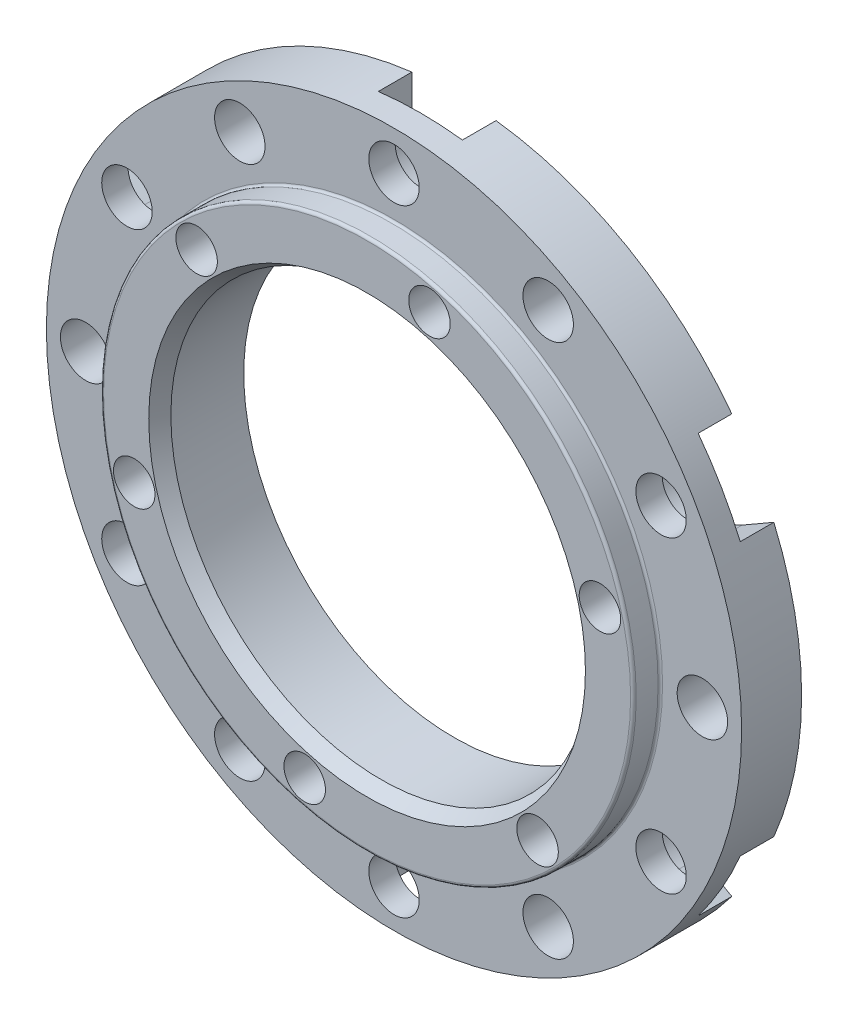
from build123d import *

# Parameters (mm, degrees)
ESQUISSE2_R      = 4.5
EXTRUSION1_DEPTH = 18
EXTRUSION2_DEPTH = 6
CONG_1_R         = 0.4
CONG_2_R         = 0.5
ESQUISSE4_R      = 3.702705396
EXTRUSION3_DEPTH = 12
CHANFREIN1_SIZE  = 2.5
CHANFREIN1_SIZE2 = 1.443375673


with BuildPart() as part:
    # Esquisse1 → R_volution1 (revolve)
    with BuildSketch(Plane(origin=(0, 0, 0), x_dir=(0, 0, -1), z_dir=(1, 0, 0)), mode=Mode.PRIVATE) as r_volution1_sk:
        Polygon((0.332564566, 37.5), (0.332564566, 47.5), (5.132564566, 47.5), (5.132564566, 62), (15.832564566, 62), (15.832564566, 37.5), align=None)
    revolve(r_volution1_sk.sketch.rotate(Axis((0, 0, 17.584601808), (0, 0, -1)), 90), axis=Axis((0, 0, 17.584601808), (0, 0, -1)))

    # Esquisse2 → Extrusion1 (cut)
    with BuildSketch(Plane(origin=(0, 0, -15.832564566), x_dir=(-1, 0, 0), z_dir=(0, 0, -1))):
        with Locations((0, 55)):
            Circle(ESQUISSE2_R)
        with Locations((27.5, 47.631397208)):
            Circle(ESQUISSE2_R)
        with Locations((47.631397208, 27.5)):
            Circle(ESQUISSE2_R)
        with Locations((55, 0)):
            Circle(ESQUISSE2_R)
        with Locations((47.631397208, -27.5)):
            Circle(ESQUISSE2_R)
        with Locations((27.5, -47.631397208)):
            Circle(ESQUISSE2_R)
        with Locations((0, -55)):
            Circle(ESQUISSE2_R)
        with Locations((-27.5, -47.631397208)):
            Circle(ESQUISSE2_R)
        with Locations((-47.631397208, -27.5)):
            Circle(ESQUISSE2_R)
        with Locations((-55, 0)):
            Circle(ESQUISSE2_R)
        with Locations((-47.631397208, 27.5)):
            Circle(ESQUISSE2_R)
        with Locations((-27.5, 47.631397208)):
            Circle(ESQUISSE2_R)
    extrude(amount=-EXTRUSION1_DEPTH, mode=Mode.SUBTRACT)

    # Esquisse3 → Extrusion2 (cut)
    with BuildSketch(Plane(origin=(0, 0, -15.832564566), x_dir=(-1, 0, 0), z_dir=(0, 0, -1))):
        with BuildLine():
            Line((7.5, 61.544699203), (7.5, 55))
            ThreePointArc((7.5, 55), (0, 47.5), (-7.5, 55))
            Line((-7.5, 55), (-7.5, 61.544699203))
            Line((-7.5, 61.544699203), (-7.5, 68.141790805))
            Line((-7.5, 68.141790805), (7.5, 68.141790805))
            Line((7.5, 68.141790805), (7.5, 61.544699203))
        make_face()
        with BuildLine():
            Line((43.881397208, 33.995190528), (49.549272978, 37.26754013))
            Line((49.549272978, 37.26754013), (55.262521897, 40.566085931))
            Line((55.262521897, 40.566085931), (62.762521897, 27.575704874))
            Line((62.762521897, 27.575704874), (57.049272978, 24.277159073))
            Line((57.049272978, 24.277159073), (51.381397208, 21.004809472))
            ThreePointArc((51.381397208, 21.004809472), (41.13620668, 23.75), (43.881397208, 33.995190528))
        make_face()
        with BuildLine():
            Line((51.381397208, -21.004809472), (57.049272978, -24.277159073))
            Line((57.049272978, -24.277159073), (62.762521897, -27.575704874))
            Line((62.762521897, -27.575704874), (55.262521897, -40.566085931))
            Line((55.262521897, -40.566085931), (49.549272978, -37.26754013))
            Line((49.549272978, -37.26754013), (43.881397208, -33.995190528))
            ThreePointArc((43.881397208, -33.995190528), (41.13620668, -23.75), (51.381397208, -21.004809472))
        make_face()
        with BuildLine():
            Line((7.5, -55), (7.5, -61.544699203))
            Line((7.5, -61.544699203), (7.5, -68.141790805))
            Line((7.5, -68.141790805), (-7.5, -68.141790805))
            Line((-7.5, -68.141790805), (-7.5, -61.544699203))
            Line((-7.5, -61.544699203), (-7.5, -55))
            ThreePointArc((-7.5, -55), (0, -47.5), (7.5, -55))
        make_face()
        with BuildLine():
            Line((-43.881397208, -33.995190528), (-49.549272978, -37.26754013))
            Line((-49.549272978, -37.26754013), (-55.262521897, -40.566085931))
            Line((-55.262521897, -40.566085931), (-62.762521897, -27.575704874))
            Line((-62.762521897, -27.575704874), (-57.049272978, -24.277159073))
            Line((-57.049272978, -24.277159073), (-51.381397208, -21.004809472))
            ThreePointArc((-51.381397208, -21.004809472), (-41.13620668, -23.75), (-43.881397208, -33.995190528))
        make_face()
        with BuildLine():
            Line((-51.381397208, 21.004809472), (-57.049272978, 24.277159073))
            Line((-57.049272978, 24.277159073), (-62.762521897, 27.575704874))
            Line((-62.762521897, 27.575704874), (-55.262521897, 40.566085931))
            Line((-55.262521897, 40.566085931), (-49.549272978, 37.26754013))
            Line((-49.549272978, 37.26754013), (-43.881397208, 33.995190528))
            ThreePointArc((-43.881397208, 33.995190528), (-41.13620668, 23.75), (-51.381397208, 21.004809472))
        make_face()
    extrude(amount=-EXTRUSION2_DEPTH, mode=Mode.SUBTRACT)

    # Cong_1
    cong_1_edges = [part.edges().sort_by_distance(p)[0] for p in [
        (-47.5, 0, -5.132564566),
    ]]
    fillet(cong_1_edges, radius=CONG_1_R)

    # Cong_2
    cong_2_edges = [part.edges().sort_by_distance(p)[0] for p in [
        (-47.5, 0, -0.332564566),
    ]]
    fillet(cong_2_edges, radius=CONG_2_R)

    # Esquisse4 → Extrusion3 (cut)
    with BuildSketch(Plane.XY.offset(-0.332564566)):
        with Locations((11.129218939, 41.53481053)):
            Circle(ESQUISSE4_R)
        with Locations((41.53481053, 11.129218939)):
            Circle(ESQUISSE4_R)
        with Locations((30.405591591, -30.405591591)):
            Circle(ESQUISSE4_R)
        with Locations((-11.129218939, -41.53481053)):
            Circle(ESQUISSE4_R)
        with Locations((-41.53481053, -11.129218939)):
            Circle(ESQUISSE4_R)
        with Locations((-30.405591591, 30.405591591)):
            Circle(ESQUISSE4_R)
    extrude(amount=-EXTRUSION3_DEPTH, mode=Mode.SUBTRACT)

    # Chanfrein1
    chanfrein1_edges = [part.edges().sort_by_distance(p)[0] for p in [
        (-37.5, 0, -0.332564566),
    ]]
    chanfrein1_side = [part.faces().sort_by_distance(p)[0] for p in [
        (-37.5, 0, -8.082564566),
    ]]
    chamfer(chanfrein1_edges, length=CHANFREIN1_SIZE, length2=CHANFREIN1_SIZE2, reference=chanfrein1_side[0])


solid = part.part
